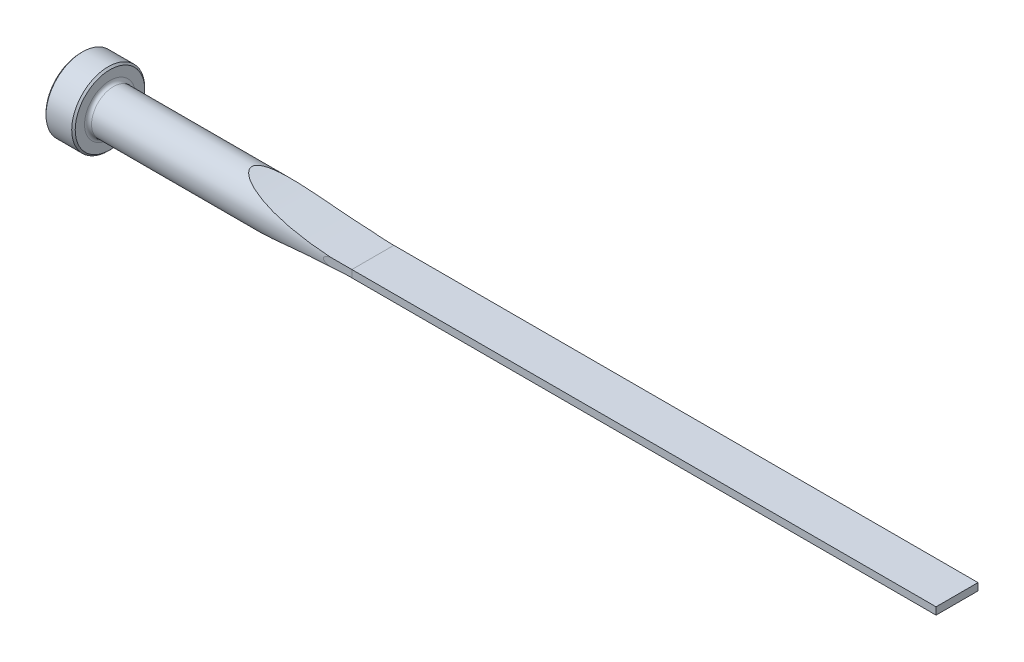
from build123d import *

# Parameters (mm, degrees)
CUT_EXTRUDE1_DEPTH = 191.830442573
CUT_EXTRUDE2_DEPTH = 191.830442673
FILLET1_R          = 0.762
CHAMFER1_SIZE      = 0.381


with BuildPart() as part:
    # Sketch1 → Revolve1 (revolve)
    with BuildSketch(Plane.XY, mode=Mode.PRIVATE) as revolve1_sk:
        Polygon((0, 0), (0, 7.9375), (6.35, 7.9375), (6.35, 4.7625), (190.5, 4.7625), (190.5, 0), align=None)
    revolve(revolve1_sk.sketch.rotate(Axis((0, 0, 0), (1, 0, 0)), 90), axis=Axis((0, 0, 0), (1, 0, 0)))

    # Sketch2 → Cut-Extrude1 (cut, symmetric)
    with BuildSketch(Plane.XY):
        with BuildLine():
            Line((190.5, 4.7625), (190.5, 0.7874))
            Line((190.5, 0.7874), (63.5, 0.7874))
            ThreePointArc((63.5, 0.7874), (50.207400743, 1.786792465), (37.213665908, 4.7625))
            Line((37.213665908, 4.7625), (190.5, 4.7625))
        make_face()
    cut_extrude1 = extrude(amount=CUT_EXTRUDE1_DEPTH, both=True, mode=Mode.SUBTRACT)

    # Mirror1: Cut-Extrude1 across plane
    add(cut_extrude1.mirror(Plane.ZX), mode=Mode.SUBTRACT)

    # Sketch3 → Cut-Extrude2 (cut, symmetric)
    with BuildSketch(Plane(origin=(0, 0, 0), x_dir=(1, 0, 0), z_dir=(0, 1, 0))):
        with BuildLine():
            Line((190.5, 4.7625), (190.5, 4.5593))
            Line((190.5, 4.5593), (63.5, 4.5593))
            ThreePointArc((63.5, 4.5593), (60.49463147, 4.610114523), (57.492698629, 4.7625))
            Line((57.492698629, 4.7625), (190.5, 4.7625))
        make_face()
    cut_extrude2 = extrude(amount=CUT_EXTRUDE2_DEPTH, both=True, mode=Mode.SUBTRACT)

    # Mirror2: Cut-Extrude2 across plane
    add(cut_extrude2.mirror(Plane.XY), mode=Mode.SUBTRACT)

    # Fillet1
    fillet1_edges = [part.edges().sort_by_distance(p)[0] for p in [
        (6.35, 0, -4.7625),
    ]]
    fillet(fillet1_edges, radius=FILLET1_R)

    # Chamfer1
    chamfer1_edges = [part.edges().sort_by_distance(p)[0] for p in [
        (6.35, 0, -7.9375),
        (0, 0, -7.9375),
    ]]
    chamfer(chamfer1_edges, length=CHAMFER1_SIZE)


solid = part.part
